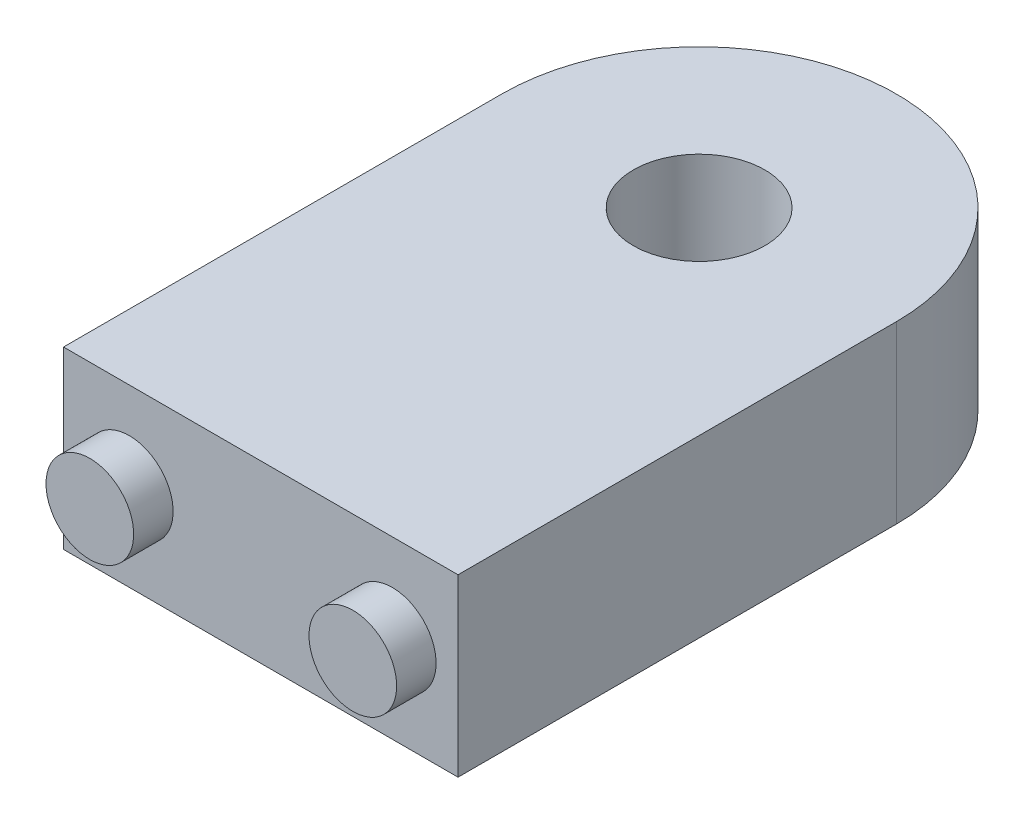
from build123d import *

# Parameters (mm, degrees)
SKETCH1_W           = 450
SKETCH1_H           = 500
BOSS_EXTRUDE1_DEPTH = 200
SKETCH2_R           = 75
CUT_EXTRUDE1_DEPTH  = 563.36109396
SKETCH4_R           = 50
BOSS_EXTRUDE2_DEPTH = 45
SKETCH5_R           = 50
BOSS_EXTRUDE3_DEPTH = 45


with BuildPart() as part:
    # Sketch1 → Boss-Extrude1 (new body)
    with BuildSketch(Plane(origin=(0, 0, 0), x_dir=(1, 0, 0), z_dir=(0, 1, 0))):
        with BuildLine():
            ThreePointArc((-225, 250), (0, 475), (225, 250))
            Line((225, 250), (-225, 250))
        make_face()
        Rectangle(SKETCH1_W, SKETCH1_H)
    extrude(amount=BOSS_EXTRUDE1_DEPTH)

    # Sketch2 → Cut-Extrude1 (cut, through all)
    with BuildSketch(Plane(origin=(0, 200, 0), x_dir=(1, 0, 0), z_dir=(0, 1, 0))):
        with Locations(Location((0, 250, 0), (0, 0, 270))):
            Circle(SKETCH2_R)
    extrude(amount=-CUT_EXTRUDE1_DEPTH, mode=Mode.SUBTRACT)

    # Sketch4 → Boss-Extrude2 (add)
    with BuildSketch(Plane.XY.offset(250)):
        with Locations(Location((150, 100, 0), (0, 0, 180))):
            Circle(SKETCH4_R)
    extrude(amount=BOSS_EXTRUDE2_DEPTH)

    # Sketch5 → Boss-Extrude3 (add)
    with BuildSketch(Plane.XY.offset(250)):
        with Locations(Location((-150, 100, 0), (0, 0, 180))):
            Circle(SKETCH5_R)
    extrude(amount=BOSS_EXTRUDE3_DEPTH)


solid = part.part
